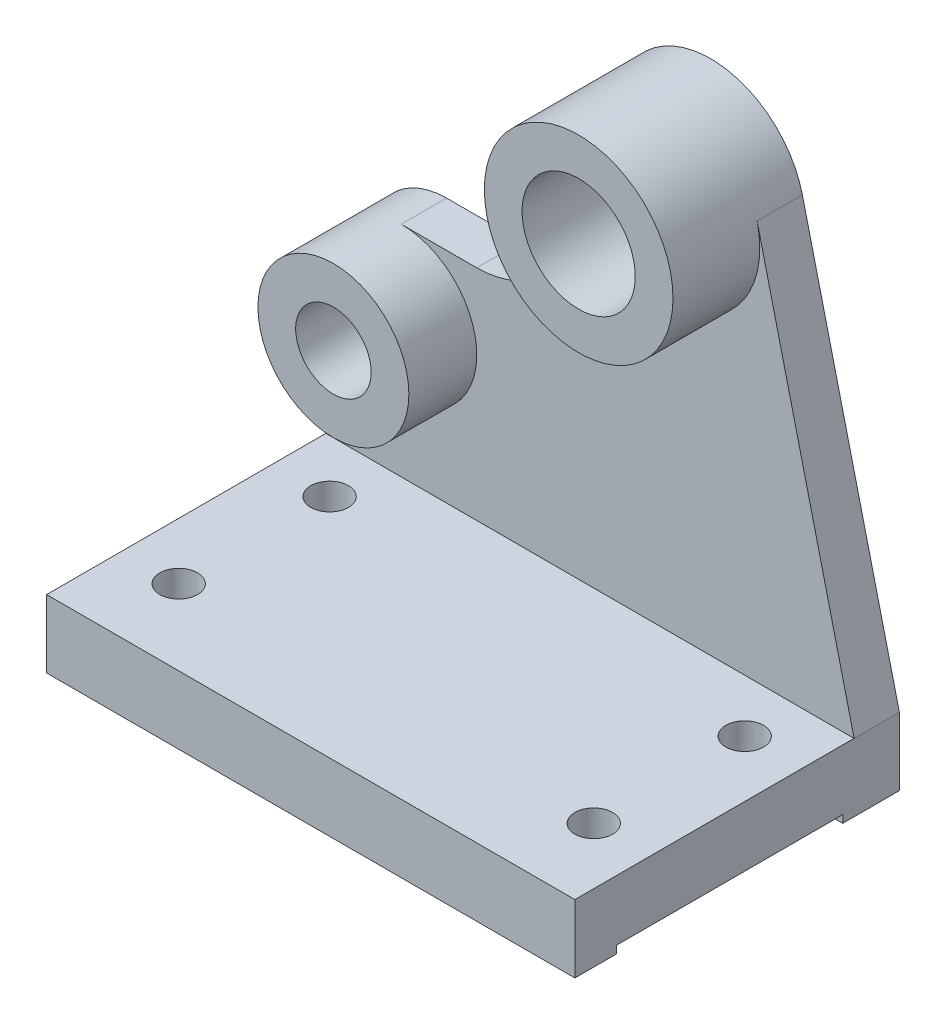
from build123d import *

# Parameters (mm, degrees)
SKETCH1_W           = 140
SKETCH1_H           = 18
BOSS_EXTRUDE1_DEPTH = 86
BOSS_EXTRUDE2_DEPTH = 12
SKETCH1_4_R         = 25
SKETCH1_4_R_2       = 15
BOSS_EXTRUDE3_DEPTH = 35
SKETCH1_5_R         = 20
SKETCH1_5_R_2       = 10
BOSS_EXTRUDE4_DEPTH = 30
SKETCH2_W           = 60
SKETCH2_H           = 2
CUT_EXTRUDE1_DEPTH  = 218.818731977
SKETCH3_R           = 5
CUT_EXTRUDE2_DEPTH  = 168.095780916


with BuildPart() as part:
    # Sketch1 → Boss-Extrude1 (new body)
    with BuildSketch(Plane.XY):
        with Locations((0, 9)):
            Rectangle(SKETCH1_W, SKETCH1_H)
    extrude(amount=BOSS_EXTRUDE1_DEPTH)

    # Sketch1_3 → Boss-Extrude2 (add)
    with BuildSketch(Plane.XY):
        with BuildLine():
            Line((70, 18), (44.294494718, 123.897247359))
            ThreePointArc((44.294494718, 123.897247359), (44.822997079, 120.969649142), (45, 118))
            ThreePointArc((45, 118), (20, 93), (-5, 118))
            Line((-5, 118), (-5, 101))
            ThreePointArc((-5, 101), (-12.32233047, 83.32233047), (-30, 76))
            Line((-30, 76), (-50, 76))
            ThreePointArc((-50, 76), (-35.857864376, 70.142135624), (-30, 56))
            ThreePointArc((-30, 56), (-50, 36), (-70, 56))
            Line((-70, 56), (-70, 18))
            Line((-70, 18), (70, 18))
        make_face()
    extrude(amount=BOSS_EXTRUDE2_DEPTH)

    # Sketch1_4 → Boss-Extrude3 (add)
    with BuildSketch(Plane.XY):
        with Locations(Location((20, 118, 0), (0, 0, 180))):
            Circle(SKETCH1_4_R)
        with Locations((20, 118)):
            Circle(SKETCH1_4_R_2, mode=Mode.SUBTRACT)
    extrude(amount=BOSS_EXTRUDE3_DEPTH)

    # Sketch1_5 → Boss-Extrude4 (add)
    with BuildSketch(Plane.XY):
        with Locations(Location((-50, 56, 0), (0, 0, 180))):
            Circle(SKETCH1_5_R)
        with Locations((-50, 56)):
            Circle(SKETCH1_5_R_2, mode=Mode.SUBTRACT)
    extrude(amount=BOSS_EXTRUDE4_DEPTH)

    # Sketch2 → Cut-Extrude1 (cut, through all)
    with BuildSketch(Plane(origin=(70, 0, 0), x_dir=(0, 0, -1), z_dir=(1, 0, 0))):
        with Locations((-45, 1)):
            Rectangle(SKETCH2_W, SKETCH2_H)
    extrude(amount=-CUT_EXTRUDE1_DEPTH, mode=Mode.SUBTRACT)

    # Sketch3 → Cut-Extrude2 (cut, through all)
    with BuildSketch(Plane(origin=(0, 18, 0), x_dir=(1, 0, 0), z_dir=(0, 1, 0))):
        with Locations(Location((-55, -66, 0), (0, 0, 270))):
            Circle(SKETCH3_R)
        with Locations(Location((55, -66, 0), (0, 0, 270))):
            Circle(SKETCH3_R)
        with Locations(Location((55, -26, 0), (0, 0, 270))):
            Circle(SKETCH3_R)
        with Locations(Location((-55, -26, 0), (0, 0, 270))):
            Circle(SKETCH3_R)
    extrude(amount=-CUT_EXTRUDE2_DEPTH, mode=Mode.SUBTRACT)


solid = part.part
